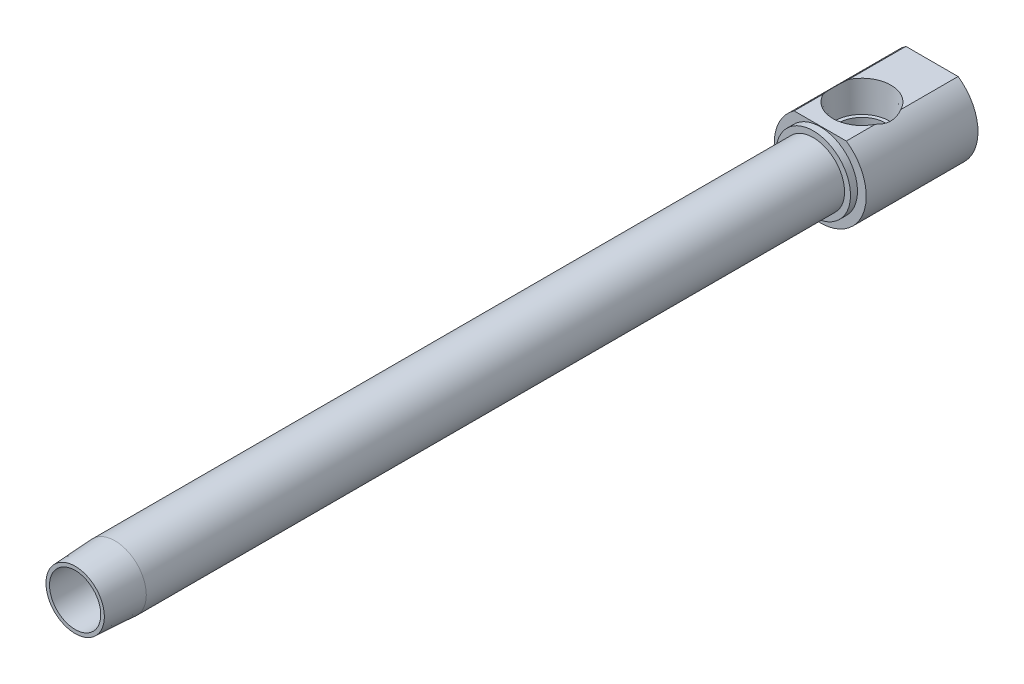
ISO-10303-21;
HEADER;
FILE_DESCRIPTION(('STEP AP214'),'2;1');
FILE_NAME('part.step','',(''),(''),'','','');
FILE_SCHEMA(('AUTOMOTIVE_DESIGN { 1 0 10303 214 1 1 1 1 }'));
ENDSEC;
DATA;
#1=APPLICATION_CONTEXT('core data for automotive mechanical design processes');
#2=APPLICATION_PROTOCOL_DEFINITION('international standard','automotive_design',2000,#1);
#3=PRODUCT_CONTEXT('',#1,'mechanical');
#4=PRODUCT('Part','Part','',(#3));
#5=PRODUCT_RELATED_PRODUCT_CATEGORY('part','',(#4));
#6=PRODUCT_DEFINITION_FORMATION('','',#4);
#7=PRODUCT_DEFINITION_CONTEXT('part definition',#1,'design');
#8=PRODUCT_DEFINITION('design','',#6,#7);
#9=PRODUCT_DEFINITION_SHAPE('','',#8);
#10=(LENGTH_UNIT() NAMED_UNIT(*) SI_UNIT(.MILLI.,.METRE.));
#11=(NAMED_UNIT(*) PLANE_ANGLE_UNIT() SI_UNIT($,.RADIAN.));
#12=(NAMED_UNIT(*) SI_UNIT($,.STERADIAN.) SOLID_ANGLE_UNIT());
#13=UNCERTAINTY_MEASURE_WITH_UNIT(LENGTH_MEASURE(1.E-05),#10,'distance_accuracy_value','');
#14=(GEOMETRIC_REPRESENTATION_CONTEXT(3) GLOBAL_UNCERTAINTY_ASSIGNED_CONTEXT((#13)) GLOBAL_UNIT_ASSIGNED_CONTEXT((#10,
#11,#12)) REPRESENTATION_CONTEXT('',''));
#15=CARTESIAN_POINT('',(0.,0.,0.));
#16=DIRECTION('',(0.,0.,1.));
#17=DIRECTION('',(1.,0.,0.));
#18=AXIS2_PLACEMENT_3D('',#15,#16,#17);
#19=CARTESIAN_POINT('',(0.,0.,-310.147166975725));
#20=DIRECTION('',(0.,0.,-1.));
#21=DIRECTION('',(-1.,0.,0.));
#22=AXIS2_PLACEMENT_3D('',#19,#20,#21);
#23=CYLINDRICAL_SURFACE('',#22,10.6883167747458);
#24=CARTESIAN_POINT('',(0.,0.,-251.6124));
#25=DIRECTION('',(0.,0.,-1.));
#26=DIRECTION('',(-1.,0.,0.));
#27=AXIS2_PLACEMENT_3D('',#24,#25,#26);
#28=CIRCLE('',#27,10.6883167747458);
#29=CARTESIAN_POINT('',(-10.6883167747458,0.,-251.6124));
#30=VERTEX_POINT('',#29);
#31=EDGE_CURVE('E143',#30,#30,#28,.T.);
#32=ORIENTED_EDGE('',*,*,#31,.F.);
#33=EDGE_LOOP('',(#32));
#34=FACE_BOUND('',#33,.T.);
#35=CARTESIAN_POINT('',(0.,0.,-13.5636));
#36=DIRECTION('',(0.,0.,1.));
#37=DIRECTION('',(1.,0.,0.));
#38=AXIS2_PLACEMENT_3D('',#35,#36,#37);
#39=CIRCLE('',#38,10.6883167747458);
#40=CARTESIAN_POINT('',(10.6883167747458,0.,-13.5636));
#41=VERTEX_POINT('',#40);
#42=EDGE_CURVE('E229',#41,#41,#39,.T.);
#43=ORIENTED_EDGE('',*,*,#42,.F.);
#44=EDGE_LOOP('',(#43));
#45=FACE_BOUND('',#44,.T.);
#46=ADVANCED_FACE('F15',(#34,#45),#23,.T.);
#47=CARTESIAN_POINT('',(-8.73125000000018,0.,0.));
#48=DIRECTION('',(0.,0.,1.));
#49=DIRECTION('',(1.,0.,0.));
#50=AXIS2_PLACEMENT_3D('',#47,#48,#49);
#51=PLANE('',#50);
#52=CARTESIAN_POINT('',(0.,0.,0.));
#53=DIRECTION('',(0.,0.,-1.));
#54=DIRECTION('',(-1.,0.,0.));
#55=AXIS2_PLACEMENT_3D('',#52,#53,#54);
#56=CIRCLE('',#55,8.73125000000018);
#57=CARTESIAN_POINT('',(-8.73125000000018,0.,0.));
#58=VERTEX_POINT('',#57);
#59=EDGE_CURVE('E19',#58,#58,#56,.T.);
#60=ORIENTED_EDGE('',*,*,#59,.T.);
#61=EDGE_LOOP('',(#60));
#62=FACE_BOUND('',#61,.T.);
#63=CARTESIAN_POINT('',(0.,0.,0.));
#64=DIRECTION('',(0.,0.,1.));
#65=DIRECTION('',(1.,0.,0.));
#66=AXIS2_PLACEMENT_3D('',#63,#64,#65);
#67=CIRCLE('',#66,9.9568);
#68=CARTESIAN_POINT('',(9.9568,0.,0.));
#69=VERTEX_POINT('',#68);
#70=EDGE_CURVE('E231',#69,#69,#67,.T.);
#71=ORIENTED_EDGE('',*,*,#70,.T.);
#72=EDGE_LOOP('',(#71));
#73=FACE_BOUND('',#72,.T.);
#74=ADVANCED_FACE('F17',(#62,#73),#51,.T.);
#75=CARTESIAN_POINT('',(-8.89,12.9217429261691,-234.95));
#76=DIRECTION('',(0.,-1.,0.));
#77=DIRECTION('',(0.,0.,-1.));
#78=AXIS2_PLACEMENT_3D('',#75,#76,#77);
#79=PLANE('',#78);
#80=DIRECTION('',(0.,0.,-1.));
#81=VECTOR('',#80,1.);
#82=CARTESIAN_POINT('',(8.89,12.9217429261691,-234.95));
#83=LINE('',#82,#81);
#84=CARTESIAN_POINT('',(8.89,12.9217429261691,-254.));
#85=VERTEX_POINT('',#84);
#86=CARTESIAN_POINT('',(8.89,12.9217429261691,-263.898054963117));
#87=VERTEX_POINT('',#86);
#88=EDGE_CURVE('E127',#85,#87,#83,.T.);
#89=ORIENTED_EDGE('',*,*,#88,.T.);
#90=CARTESIAN_POINT('',(0.,12.9217429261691,-268.224));
#91=DIRECTION('',(0.,-1.,0.));
#92=DIRECTION('',(0.,0.,-1.));
#93=AXIS2_PLACEMENT_3D('',#90,#91,#92);
#94=CIRCLE('',#93,9.88665264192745);
#95=CARTESIAN_POINT('',(-8.89,12.9217429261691,-263.898054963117));
#96=VERTEX_POINT('',#95);
#97=EDGE_CURVE('E111',#87,#96,#94,.T.);
#98=ORIENTED_EDGE('',*,*,#97,.T.);
#99=DIRECTION('',(0.,0.,-1.));
#100=VECTOR('',#99,1.);
#101=CARTESIAN_POINT('',(-8.89,12.9217429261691,-234.95));
#102=LINE('',#101,#100);
#103=CARTESIAN_POINT('',(-8.89,12.9217429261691,-254.));
#104=VERTEX_POINT('',#103);
#105=EDGE_CURVE('E138',#104,#96,#102,.T.);
#106=ORIENTED_EDGE('',*,*,#105,.F.);
#107=DIRECTION('',(1.,0.,0.));
#108=VECTOR('',#107,1.);
#109=CARTESIAN_POINT('',(-12.7,12.9217429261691,-254.));
#110=LINE('',#109,#108);
#111=EDGE_CURVE('E135',#104,#85,#110,.T.);
#112=ORIENTED_EDGE('',*,*,#111,.T.);
#113=EDGE_LOOP('',(#89,#98,#106,#112));
#114=FACE_BOUND('',#113,.T.);
#115=ADVANCED_FACE('F133',(#114),#79,.F.);
#116=CARTESIAN_POINT('',(-8.73125000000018,0.,-252.027796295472));
#117=DIRECTION('',(0.,0.,1.));
#118=DIRECTION('',(1.,0.,0.));
#119=AXIS2_PLACEMENT_3D('',#116,#117,#118);
#120=PLANE('',#119);
#121=CARTESIAN_POINT('',(0.,0.,-252.027796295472));
#122=DIRECTION('',(0.,0.,-1.));
#123=DIRECTION('',(-1.,0.,0.));
#124=AXIS2_PLACEMENT_3D('',#121,#122,#123);
#125=CIRCLE('',#124,8.73125000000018);
#126=CARTESIAN_POINT('',(-8.73125000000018,0.,-252.027796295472));
#127=VERTEX_POINT('',#126);
#128=EDGE_CURVE('E157',#127,#127,#125,.T.);
#129=ORIENTED_EDGE('',*,*,#128,.F.);
#130=EDGE_LOOP('',(#129));
#131=FACE_BOUND('',#130,.T.);
#132=CARTESIAN_POINT('',(0.,-1.53831558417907,-252.027796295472));
#133=DIRECTION('',(0.,0.,1.));
#134=DIRECTION('',(0.,1.,0.));
#135=AXIS2_PLACEMENT_3D('',#132,#133,#134);
#136=ELLIPSE('',#135,7.0682508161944,6.80767250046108);
#137=CARTESIAN_POINT('',(0.,5.52993523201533,-252.027796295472));
#138=VERTEX_POINT('',#137);
#139=EDGE_CURVE('E162',#138,#138,#136,.F.);
#140=ORIENTED_EDGE('',*,*,#139,.T.);
#141=EDGE_LOOP('',(#140));
#142=FACE_BOUND('',#141,.T.);
#143=ADVANCED_FACE('F211',(#131,#142),#120,.T.);
#144=CARTESIAN_POINT('',(0.,0.,-310.147166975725));
#145=DIRECTION('',(0.,0.,-1.));
#146=DIRECTION('',(-1.,0.,0.));
#147=AXIS2_PLACEMENT_3D('',#144,#145,#146);
#148=CYLINDRICAL_SURFACE('',#147,8.73125000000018);
#149=ORIENTED_EDGE('',*,*,#128,.T.);
#150=EDGE_LOOP('',(#149));
#151=FACE_BOUND('',#150,.T.);
#152=ORIENTED_EDGE('',*,*,#59,.F.);
#153=EDGE_LOOP('',(#152));
#154=FACE_BOUND('',#153,.T.);
#155=ADVANCED_FACE('F209',(#151,#154),#148,.F.);
#156=CARTESIAN_POINT('',(-15.6845,0.,-292.1));
#157=DIRECTION('',(0.,0.,-1.));
#158=DIRECTION('',(-1.,0.,0.));
#159=AXIS2_PLACEMENT_3D('',#156,#157,#158);
#160=PLANE('',#159);
#161=DIRECTION('',(1.,0.,0.));
#162=VECTOR('',#161,1.);
#163=CARTESIAN_POINT('',(-3.66617420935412,6.35,-292.1));
#164=LINE('',#163,#162);
#165=CARTESIAN_POINT('',(-3.66617420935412,6.35,-292.1));
#166=VERTEX_POINT('',#165);
#167=CARTESIAN_POINT('',(3.66617420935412,6.35,-292.1));
#168=VERTEX_POINT('',#167);
#169=EDGE_CURVE('E165',#166,#168,#164,.T.);
#170=ORIENTED_EDGE('',*,*,#169,.F.);
#171=DIRECTION('',(0.5,0.866025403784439,0.));
#172=VECTOR('',#171,1.);
#173=CARTESIAN_POINT('',(-7.33234841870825,0.,-292.1));
#174=LINE('',#173,#172);
#175=CARTESIAN_POINT('',(-7.33234841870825,0.,-292.1));
#176=VERTEX_POINT('',#175);
#177=EDGE_CURVE('E284',#176,#166,#174,.T.);
#178=ORIENTED_EDGE('',*,*,#177,.F.);
#179=DIRECTION('',(-0.5,0.866025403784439,0.));
#180=VECTOR('',#179,1.);
#181=CARTESIAN_POINT('',(-3.66617420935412,-6.35,-292.1));
#182=LINE('',#181,#180);
#183=CARTESIAN_POINT('',(-3.66617420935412,-6.35,-292.1));
#184=VERTEX_POINT('',#183);
#185=EDGE_CURVE('E310',#184,#176,#182,.T.);
#186=ORIENTED_EDGE('',*,*,#185,.F.);
#187=DIRECTION('',(-1.,0.,0.));
#188=VECTOR('',#187,1.);
#189=CARTESIAN_POINT('',(3.66617420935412,-6.35,-292.1));
#190=LINE('',#189,#188);
#191=CARTESIAN_POINT('',(3.66617420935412,-6.35,-292.1));
#192=VERTEX_POINT('',#191);
#193=EDGE_CURVE('E307',#192,#184,#190,.T.);
#194=ORIENTED_EDGE('',*,*,#193,.F.);
#195=DIRECTION('',(-0.5,-0.866025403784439,0.));
#196=VECTOR('',#195,1.);
#197=CARTESIAN_POINT('',(7.33234841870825,0.,-292.1));
#198=LINE('',#197,#196);
#199=CARTESIAN_POINT('',(7.33234841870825,0.,-292.1));
#200=VERTEX_POINT('',#199);
#201=EDGE_CURVE('E304',#200,#192,#198,.T.);
#202=ORIENTED_EDGE('',*,*,#201,.F.);
#203=DIRECTION('',(0.5,-0.866025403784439,0.));
#204=VECTOR('',#203,1.);
#205=CARTESIAN_POINT('',(3.66617420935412,6.35,-292.1));
#206=LINE('',#205,#204);
#207=EDGE_CURVE('E301',#168,#200,#206,.T.);
#208=ORIENTED_EDGE('',*,*,#207,.F.);
#209=EDGE_LOOP('',(#170,#178,#186,#194,#202,#208));
#210=FACE_BOUND('',#209,.T.);
#211=DIRECTION('',(-1.,0.,0.));
#212=VECTOR('',#211,1.);
#213=CARTESIAN_POINT('',(-8.89,12.9217429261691,-292.1));
#214=LINE('',#213,#212);
#215=CARTESIAN_POINT('',(8.89,12.9217429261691,-292.1));
#216=VERTEX_POINT('',#215);
#217=CARTESIAN_POINT('',(-8.89,12.9217429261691,-292.1));
#218=VERTEX_POINT('',#217);
#219=EDGE_CURVE('E140',#216,#218,#214,.T.);
#220=ORIENTED_EDGE('',*,*,#219,.F.);
#221=CARTESIAN_POINT('',(0.,0.,-292.1));
#222=DIRECTION('',(0.,0.,-1.));
#223=DIRECTION('',(-1.,0.,0.));
#224=AXIS2_PLACEMENT_3D('',#221,#222,#223);
#225=CIRCLE('',#224,15.6845);
#226=EDGE_CURVE('E154',#216,#218,#225,.T.);
#227=ORIENTED_EDGE('',*,*,#226,.T.);
#228=EDGE_LOOP('',(#220,#227));
#229=FACE_BOUND('',#228,.T.);
#230=ADVANCED_FACE('F204',(#210,#229),#160,.T.);
#231=CARTESIAN_POINT('',(0.,0.,-310.147166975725));
#232=DIRECTION('',(0.,0.,-1.));
#233=DIRECTION('',(-1.,0.,0.));
#234=AXIS2_PLACEMENT_3D('',#231,#232,#233);
#235=CYLINDRICAL_SURFACE('',#234,15.6845);
#236=CARTESIAN_POINT('',(6.18126199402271,14.4151149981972,-260.407890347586));
#237=CARTESIAN_POINT('',(6.40820210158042,14.317827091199,-260.593892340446));
#238=CARTESIAN_POINT('',(6.62617183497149,14.2179923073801,-260.789429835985));
#239=CARTESIAN_POINT('',(7.04356392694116,14.015896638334,-261.198561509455));
#240=CARTESIAN_POINT('',(7.24297338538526,13.9136341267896,-261.412168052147));
#241=CARTESIAN_POINT('',(7.62085258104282,13.7102837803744,-261.854442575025));
#242=CARTESIAN_POINT('',(7.79947267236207,13.6091929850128,-262.082980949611));
#243=CARTESIAN_POINT('',(8.13667540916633,13.4103063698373,-262.555534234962));
#244=CARTESIAN_POINT('',(8.29527210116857,13.3125082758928,-262.799538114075));
#245=CARTESIAN_POINT('',(8.52405372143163,13.1663669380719,-263.187604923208));
#246=CARTESIAN_POINT('',(8.60159506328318,13.1157948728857,-263.326544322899));
#247=CARTESIAN_POINT('',(8.75042416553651,13.0169736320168,-263.608789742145));
#248=CARTESIAN_POINT('',(8.82170394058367,12.9687274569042,-263.75210103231));
#249=CARTESIAN_POINT('',(8.98942344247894,12.85334420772,-264.110530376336));
#250=CARTESIAN_POINT('',(9.08209775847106,12.7878879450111,-264.327972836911));
#251=CARTESIAN_POINT('',(9.25265845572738,12.6650269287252,-264.770791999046));
#252=CARTESIAN_POINT('',(9.33054529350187,12.6076219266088,-264.996168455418));
#253=CARTESIAN_POINT('',(9.47086217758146,12.5025600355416,-265.454136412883));
#254=CARTESIAN_POINT('',(9.53327990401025,12.4549109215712,-265.686733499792));
#255=CARTESIAN_POINT('',(9.64181076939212,12.3710847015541,-266.157621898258));
#256=CARTESIAN_POINT('',(9.68793245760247,12.3349015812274,-266.395910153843));
#257=CARTESIAN_POINT('',(9.76349281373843,12.2751820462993,-266.878204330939));
#258=CARTESIAN_POINT('',(9.79282896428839,12.2517233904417,-267.122236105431));
#259=CARTESIAN_POINT('',(9.83390591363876,12.2187780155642,-267.612731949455));
#260=CARTESIAN_POINT('',(9.84564637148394,12.2092915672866,-267.859196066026));
#261=CARTESIAN_POINT('',(9.85132494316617,12.2047101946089,-268.352460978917));
#262=CARTESIAN_POINT('',(9.84526326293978,12.2096151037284,-268.599261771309));
#263=CARTESIAN_POINT('',(9.81544491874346,12.233598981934,-269.091077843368));
#264=CARTESIAN_POINT('',(9.79168936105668,12.2526770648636,-269.336093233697));
#265=CARTESIAN_POINT('',(9.7294701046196,12.3021291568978,-269.803007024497));
#266=CARTESIAN_POINT('',(9.69232783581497,12.3314830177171,-270.025192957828));
#267=CARTESIAN_POINT('',(9.60385268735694,12.400512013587,-270.465181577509));
#268=CARTESIAN_POINT('',(9.55251354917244,12.4401917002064,-270.682982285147));
#269=CARTESIAN_POINT('',(9.43631194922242,12.5285621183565,-271.112660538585));
#270=CARTESIAN_POINT('',(9.37147123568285,12.5772383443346,-271.324546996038));
#271=CARTESIAN_POINT('',(9.22879623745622,12.6822986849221,-271.741936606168));
#272=CARTESIAN_POINT('',(9.15096192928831,12.7386828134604,-271.947439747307));
#273=CARTESIAN_POINT('',(9.01061877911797,12.838109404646,-272.284726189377));
#274=CARTESIAN_POINT('',(8.95152353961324,12.8794177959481,-272.418466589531));
#275=CARTESIAN_POINT('',(8.76461266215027,13.0080031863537,-272.817903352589));
#276=CARTESIAN_POINT('',(8.62838014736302,13.0990466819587,-273.078521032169));
#277=CARTESIAN_POINT('',(8.33484719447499,13.2877507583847,-273.585122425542));
#278=CARTESIAN_POINT('',(8.17753852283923,13.3854139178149,-273.831100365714));
#279=CARTESIAN_POINT('',(7.84238437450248,13.5844995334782,-274.3080815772));
#280=CARTESIAN_POINT('',(7.66448703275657,13.685931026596,-274.539044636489));
#281=CARTESIAN_POINT('',(7.28939666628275,13.8893391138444,-274.984214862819));
#282=CARTESIAN_POINT('',(7.09221474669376,13.9913153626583,-275.198431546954));
#283=CARTESIAN_POINT('',(6.68803601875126,14.1888008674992,-275.600395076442));
#284=CARTESIAN_POINT('',(6.48182024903,14.284400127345,-275.788882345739));
#285=CARTESIAN_POINT('',(6.05384699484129,14.4709681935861,-276.147789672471));
#286=CARTESIAN_POINT('',(5.83215453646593,14.5619538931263,-276.318278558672));
#287=CARTESIAN_POINT('',(5.60267382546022,14.6496957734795,-276.479590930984));
#288=B_SPLINE_CURVE_WITH_KNOTS('',3,(#236,#237,#238,#239,#240,#241,#242,#243,#244,#245,#246,
#247,#248,#249,#250,#251,#252,#253,#254,#255,#256,#257,#258,#259,#260,#261,#262,#263,#264,#265,
#266,#267,#268,#269,#270,#271,#272,#273,#274,#275,#276,#277,#278,#279,#280,#281,#282,#283,#284,
#285,#286,#287),.UNSPECIFIED.,.F.,.F.,(4,2,2,2,2,2,2,2,2,2,2,2,2,2,2,2,2,2,2,2,2,2,2,2,2,4),(0.,
0.927053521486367,1.85474664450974,2.77524763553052,3.69509925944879,4.19580328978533,
4.69713686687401,5.43222687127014,6.16729417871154,6.90294503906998,7.63820938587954,
8.37791768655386,9.11764032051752,9.85735439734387,10.5970222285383,11.2778067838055,
11.9588919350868,12.6388883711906,13.3188860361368,13.7745816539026,14.696795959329,
15.6193715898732,16.5443240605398,17.4687469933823,18.3536130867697,19.2349623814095),.UNSPECIFIED.);
#289=CARTESIAN_POINT('',(8.89,12.9217429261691,-272.549945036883));
#290=VERTEX_POINT('',#289);
#291=EDGE_CURVE('E31',#87,#290,#288,.T.);
#292=ORIENTED_EDGE('',*,*,#291,.F.);
#293=ORIENTED_EDGE('',*,*,#88,.F.);
#294=CARTESIAN_POINT('',(0.,0.,-254.));
#295=DIRECTION('',(0.,0.,-1.));
#296=DIRECTION('',(-1.,0.,0.));
#297=AXIS2_PLACEMENT_3D('',#294,#295,#296);
#298=CIRCLE('',#297,15.6845);
#299=EDGE_CURVE('E152',#85,#104,#298,.T.);
#300=ORIENTED_EDGE('',*,*,#299,.T.);
#301=ORIENTED_EDGE('',*,*,#105,.T.);
#302=CARTESIAN_POINT('',(-5.60267382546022,14.6496957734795,-276.479590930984));
#303=CARTESIAN_POINT('',(-5.83916916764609,14.5592741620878,-276.313346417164));
#304=CARTESIAN_POINT('',(-6.0673939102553,14.4654038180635,-276.137356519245));
#305=CARTESIAN_POINT('',(-6.50657666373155,14.2732361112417,-275.767106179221));
#306=CARTESIAN_POINT('',(-6.71753229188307,14.1749381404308,-275.572843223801));
#307=CARTESIAN_POINT('',(-7.12045557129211,13.9768691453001,-275.16824748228));
#308=CARTESIAN_POINT('',(-7.31250621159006,13.8771069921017,-274.957992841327));
#309=CARTESIAN_POINT('',(-7.67797599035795,13.6782845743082,-274.521703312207));
#310=CARTESIAN_POINT('',(-7.85140185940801,13.5792240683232,-274.295674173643));
#311=CARTESIAN_POINT('',(-8.18139016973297,13.3830412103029,-273.825173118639));
#312=CARTESIAN_POINT('',(-8.33766306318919,13.2859696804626,-273.580476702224));
#313=CARTESIAN_POINT('',(-8.62954581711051,13.0982677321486,-273.076292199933));
#314=CARTESIAN_POINT('',(-8.76513502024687,13.0076438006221,-272.816789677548));
#315=CARTESIAN_POINT('',(-8.98947377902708,12.8533099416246,-272.337363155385));
#316=CARTESIAN_POINT('',(-9.08217383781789,12.7878343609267,-272.119849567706));
#317=CARTESIAN_POINT('',(-9.25276992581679,12.6649454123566,-271.676898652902));
#318=CARTESIAN_POINT('',(-9.33066889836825,12.6075304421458,-271.451462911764));
#319=CARTESIAN_POINT('',(-9.47096094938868,12.5024850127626,-270.993506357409));
#320=CARTESIAN_POINT('',(-9.53335030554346,12.4548569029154,-270.76098385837));
#321=CARTESIAN_POINT('',(-9.64183755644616,12.3710636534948,-270.290239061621));
#322=CARTESIAN_POINT('',(-9.68794342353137,12.3348929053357,-270.052019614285));
#323=CARTESIAN_POINT('',(-9.76349062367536,12.2751837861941,-269.569809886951));
#324=CARTESIAN_POINT('',(-9.79282550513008,12.2517261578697,-269.325792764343));
#325=CARTESIAN_POINT('',(-9.83390185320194,12.2187812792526,-268.835328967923));
#326=CARTESIAN_POINT('',(-9.84564316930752,12.2092941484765,-268.588882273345));
#327=CARTESIAN_POINT('',(-9.85132631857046,12.2047090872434,-268.095619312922));
#328=CARTESIAN_POINT('',(-9.84526600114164,12.2096128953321,-267.848803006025));
#329=CARTESIAN_POINT('',(-9.81544809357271,12.2335964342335,-267.356954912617));
#330=CARTESIAN_POINT('',(-9.79169153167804,12.2526753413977,-267.111923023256));
#331=CARTESIAN_POINT('',(-9.72947134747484,12.3021281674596,-266.645002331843));
#332=CARTESIAN_POINT('',(-9.69233092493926,12.3314805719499,-266.422825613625));
#333=CARTESIAN_POINT('',(-9.60386128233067,12.4005053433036,-265.982857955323));
#334=CARTESIAN_POINT('',(-9.55252598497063,12.4401821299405,-265.7650689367));
#335=CARTESIAN_POINT('',(-9.43632738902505,12.5285504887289,-265.33539132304));
#336=CARTESIAN_POINT('',(-9.37148448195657,12.5772284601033,-265.123494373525));
#337=CARTESIAN_POINT('',(-9.22880457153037,12.6822926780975,-264.706085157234));
#338=CARTESIAN_POINT('',(-9.15096746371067,12.7386789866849,-264.500572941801));
#339=CARTESIAN_POINT('',(-9.01061796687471,12.8381099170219,-264.163272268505));
#340=CARTESIAN_POINT('',(-8.95152097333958,12.8794194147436,-264.029528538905));
#341=CARTESIAN_POINT('',(-8.80068775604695,12.9831855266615,-263.707189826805));
#342=CARTESIAN_POINT('',(-8.70603543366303,13.0469462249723,-263.520366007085));
#343=CARTESIAN_POINT('',(-8.50583150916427,13.1783430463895,-263.153845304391));
#344=CARTESIAN_POINT('',(-8.40026939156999,13.2459828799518,-262.974155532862));
#345=CARTESIAN_POINT('',(-8.14693598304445,13.403699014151,-262.572018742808));
#346=CARTESIAN_POINT('',(-7.99573471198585,13.4946529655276,-262.352065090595));
#347=CARTESIAN_POINT('',(-7.67663330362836,13.6786987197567,-261.925415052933));
#348=CARTESIAN_POINT('',(-7.50872479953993,13.7717915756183,-261.718725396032));
#349=CARTESIAN_POINT('',(-7.1565512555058,13.9580450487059,-261.319106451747));
#350=CARTESIAN_POINT('',(-6.97225920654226,14.0512055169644,-261.126200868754));
#351=CARTESIAN_POINT('',(-6.58822039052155,14.2353204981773,-260.755512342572));
#352=CARTESIAN_POINT('',(-6.38848080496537,14.3262760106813,-260.577722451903));
#353=CARTESIAN_POINT('',(-6.18126199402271,14.4151149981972,-260.407890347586));
#354=B_SPLINE_CURVE_WITH_KNOTS('',3,(#302,#303,#304,#305,#306,#307,#308,#309,#310,#311,#312,
#313,#314,#315,#316,#317,#318,#319,#320,#321,#322,#323,#324,#325,#326,#327,#328,#329,#330,#331,
#332,#333,#334,#335,#336,#337,#338,#339,#340,#341,#342,#343,#344,#345,#346,#347,#348,#349,#350,
#351,#352,#353),.UNSPECIFIED.,.F.,.F.,(4,2,2,2,2,2,2,2,2,2,2,2,2,2,2,2,2,2,2,2,2,2,2,2,2,4),(0.,
0.908274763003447,1.81667463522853,2.72089010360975,3.62477770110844,4.54212421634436,
5.46038099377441,6.19576092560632,6.93099446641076,7.66640429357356,8.40145356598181,
9.14111809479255,9.88078895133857,10.6205491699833,11.360266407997,12.0410224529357,
12.7220704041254,13.4020975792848,14.0821302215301,14.5378258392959,15.1941212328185,
15.8510552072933,16.6961350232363,17.5416401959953,18.3885660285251,19.2351004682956),.UNSPECIFIED.);
#355=CARTESIAN_POINT('',(-8.89,12.9217429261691,-272.549945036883));
#356=VERTEX_POINT('',#355);
#357=EDGE_CURVE('E115',#356,#96,#354,.T.);
#358=ORIENTED_EDGE('',*,*,#357,.F.);
#359=EDGE_CURVE('E136',#356,#218,#102,.T.);
#360=ORIENTED_EDGE('',*,*,#359,.T.);
#361=ORIENTED_EDGE('',*,*,#226,.F.);
#362=EDGE_CURVE('E130',#290,#216,#83,.T.);
#363=ORIENTED_EDGE('',*,*,#362,.F.);
#364=EDGE_LOOP('',(#292,#293,#300,#301,#358,#360,#361,#363));
#365=FACE_BOUND('',#364,.T.);
#366=ADVANCED_FACE('F125',(#365),#235,.T.);
#367=CARTESIAN_POINT('',(-12.7,0.,-254.));
#368=DIRECTION('',(0.,0.,1.));
#369=DIRECTION('',(1.,0.,0.));
#370=AXIS2_PLACEMENT_3D('',#367,#368,#369);
#371=PLANE('',#370);
#372=ORIENTED_EDGE('',*,*,#111,.F.);
#373=ORIENTED_EDGE('',*,*,#299,.F.);
#374=EDGE_LOOP('',(#372,#373));
#375=FACE_BOUND('',#374,.T.);
#376=CARTESIAN_POINT('',(0.,0.,-254.));
#377=DIRECTION('',(0.,0.,-1.));
#378=DIRECTION('',(-1.,0.,0.));
#379=AXIS2_PLACEMENT_3D('',#376,#377,#378);
#380=CIRCLE('',#379,12.7);
#381=CARTESIAN_POINT('',(-12.7,0.,-254.));
#382=VERTEX_POINT('',#381);
#383=EDGE_CURVE('E149',#382,#382,#380,.T.);
#384=ORIENTED_EDGE('',*,*,#383,.T.);
#385=EDGE_LOOP('',(#384));
#386=FACE_BOUND('',#385,.T.);
#387=ADVANCED_FACE('F203',(#375,#386),#371,.T.);
#388=CARTESIAN_POINT('',(0.,0.,-310.147166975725));
#389=DIRECTION('',(0.,0.,-1.));
#390=DIRECTION('',(-1.,0.,0.));
#391=AXIS2_PLACEMENT_3D('',#388,#389,#390);
#392=CYLINDRICAL_SURFACE('',#391,12.7);
#393=CARTESIAN_POINT('',(0.,0.,-251.6124));
#394=DIRECTION('',(0.,0.,-1.));
#395=DIRECTION('',(-1.,0.,0.));
#396=AXIS2_PLACEMENT_3D('',#393,#394,#395);
#397=CIRCLE('',#396,12.7);
#398=CARTESIAN_POINT('',(-12.7,0.,-251.6124));
#399=VERTEX_POINT('',#398);
#400=EDGE_CURVE('E146',#399,#399,#397,.T.);
#401=ORIENTED_EDGE('',*,*,#400,.T.);
#402=EDGE_LOOP('',(#401));
#403=FACE_BOUND('',#402,.T.);
#404=ORIENTED_EDGE('',*,*,#383,.F.);
#405=EDGE_LOOP('',(#404));
#406=FACE_BOUND('',#405,.T.);
#407=ADVANCED_FACE('F335',(#403,#406),#392,.T.);
#408=CARTESIAN_POINT('',(-10.6883167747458,0.,-251.6124));
#409=DIRECTION('',(0.,0.,1.));
#410=DIRECTION('',(1.,0.,0.));
#411=AXIS2_PLACEMENT_3D('',#408,#409,#410);
#412=PLANE('',#411);
#413=ORIENTED_EDGE('',*,*,#31,.T.);
#414=EDGE_LOOP('',(#413));
#415=FACE_BOUND('',#414,.T.);
#416=ORIENTED_EDGE('',*,*,#400,.F.);
#417=EDGE_LOOP('',(#416));
#418=FACE_BOUND('',#417,.T.);
#419=ADVANCED_FACE('F339',(#415,#418),#412,.T.);
#420=ORIENTED_EDGE('',*,*,#359,.F.);
#421=EDGE_CURVE('E120',#356,#290,#94,.T.);
#422=ORIENTED_EDGE('',*,*,#421,.T.);
#423=ORIENTED_EDGE('',*,*,#362,.T.);
#424=ORIENTED_EDGE('',*,*,#219,.T.);
#425=EDGE_LOOP('',(#420,#422,#423,#424));
#426=FACE_BOUND('',#425,.T.);
#427=ADVANCED_FACE('F330',(#426),#79,.F.);
#428=CARTESIAN_POINT('',(-3.66617420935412,6.35,-285.75));
#429=DIRECTION('',(0.,1.,0.));
#430=DIRECTION('',(-1.,0.,0.));
#431=AXIS2_PLACEMENT_3D('',#428,#429,#430);
#432=PLANE('',#431);
#433=ORIENTED_EDGE('',*,*,#169,.T.);
#434=DIRECTION('',(0.,0.,-1.));
#435=VECTOR('',#434,1.);
#436=CARTESIAN_POINT('',(3.66617420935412,6.35,-285.75));
#437=LINE('',#436,#435);
#438=CARTESIAN_POINT('',(3.66617420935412,6.35,-285.75));
#439=VERTEX_POINT('',#438);
#440=EDGE_CURVE('E299',#439,#168,#437,.T.);
#441=ORIENTED_EDGE('',*,*,#440,.F.);
#442=DIRECTION('',(1.,0.,0.));
#443=VECTOR('',#442,1.);
#444=CARTESIAN_POINT('',(-3.66617420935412,6.35,-285.75));
#445=LINE('',#444,#443);
#446=CARTESIAN_POINT('',(-3.66617420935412,6.35,-285.75));
#447=VERTEX_POINT('',#446);
#448=EDGE_CURVE('E280',#447,#439,#445,.T.);
#449=ORIENTED_EDGE('',*,*,#448,.F.);
#450=DIRECTION('',(0.,0.,-1.));
#451=VECTOR('',#450,1.);
#452=CARTESIAN_POINT('',(-3.66617420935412,6.35,-285.75));
#453=LINE('',#452,#451);
#454=EDGE_CURVE('E315',#447,#166,#453,.T.);
#455=ORIENTED_EDGE('',*,*,#454,.T.);
#456=EDGE_LOOP('',(#433,#441,#449,#455));
#457=FACE_BOUND('',#456,.T.);
#458=ADVANCED_FACE('F350',(#457),#432,.F.);
#459=CARTESIAN_POINT('',(-7.33234841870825,0.,-285.75));
#460=DIRECTION('',(-0.866025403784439,0.5,0.));
#461=DIRECTION('',(-0.5,-0.866025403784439,0.));
#462=AXIS2_PLACEMENT_3D('',#459,#460,#461);
#463=PLANE('',#462);
#464=ORIENTED_EDGE('',*,*,#177,.T.);
#465=ORIENTED_EDGE('',*,*,#454,.F.);
#466=DIRECTION('',(0.5,0.866025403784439,0.));
#467=VECTOR('',#466,1.);
#468=CARTESIAN_POINT('',(-7.33234841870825,0.,-285.75));
#469=LINE('',#468,#467);
#470=CARTESIAN_POINT('',(-7.33234841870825,0.,-285.75));
#471=VERTEX_POINT('',#470);
#472=EDGE_CURVE('E296',#471,#447,#469,.T.);
#473=ORIENTED_EDGE('',*,*,#472,.F.);
#474=DIRECTION('',(0.,0.,-1.));
#475=VECTOR('',#474,1.);
#476=CARTESIAN_POINT('',(-7.33234841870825,0.,-285.75));
#477=LINE('',#476,#475);
#478=EDGE_CURVE('E317',#471,#176,#477,.T.);
#479=ORIENTED_EDGE('',*,*,#478,.T.);
#480=EDGE_LOOP('',(#464,#465,#473,#479));
#481=FACE_BOUND('',#480,.T.);
#482=ADVANCED_FACE('F353',(#481),#463,.F.);
#483=CARTESIAN_POINT('',(-3.66617420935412,-6.35,-285.75));
#484=DIRECTION('',(-0.866025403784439,-0.5,0.));
#485=DIRECTION('',(0.5,-0.866025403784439,0.));
#486=AXIS2_PLACEMENT_3D('',#483,#484,#485);
#487=PLANE('',#486);
#488=ORIENTED_EDGE('',*,*,#185,.T.);
#489=ORIENTED_EDGE('',*,*,#478,.F.);
#490=DIRECTION('',(-0.5,0.866025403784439,0.));
#491=VECTOR('',#490,1.);
#492=CARTESIAN_POINT('',(-3.66617420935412,-6.35,-285.75));
#493=LINE('',#492,#491);
#494=CARTESIAN_POINT('',(-3.66617420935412,-6.35,-285.75));
#495=VERTEX_POINT('',#494);
#496=EDGE_CURVE('E293',#495,#471,#493,.T.);
#497=ORIENTED_EDGE('',*,*,#496,.F.);
#498=DIRECTION('',(0.,0.,-1.));
#499=VECTOR('',#498,1.);
#500=CARTESIAN_POINT('',(-3.66617420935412,-6.35,-285.75));
#501=LINE('',#500,#499);
#502=EDGE_CURVE('E319',#495,#184,#501,.T.);
#503=ORIENTED_EDGE('',*,*,#502,.T.);
#504=EDGE_LOOP('',(#488,#489,#497,#503));
#505=FACE_BOUND('',#504,.T.);
#506=ADVANCED_FACE('F367',(#505),#487,.F.);
#507=CARTESIAN_POINT('',(3.66617420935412,-6.35,-285.75));
#508=DIRECTION('',(0.,-1.,0.));
#509=DIRECTION('',(1.,0.,0.));
#510=AXIS2_PLACEMENT_3D('',#507,#508,#509);
#511=PLANE('',#510);
#512=ORIENTED_EDGE('',*,*,#193,.T.);
#513=ORIENTED_EDGE('',*,*,#502,.F.);
#514=DIRECTION('',(-1.,0.,0.));
#515=VECTOR('',#514,1.);
#516=CARTESIAN_POINT('',(3.66617420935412,-6.35,-285.75));
#517=LINE('',#516,#515);
#518=CARTESIAN_POINT('',(3.66617420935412,-6.35,-285.75));
#519=VERTEX_POINT('',#518);
#520=EDGE_CURVE('E290',#519,#495,#517,.T.);
#521=ORIENTED_EDGE('',*,*,#520,.F.);
#522=DIRECTION('',(0.,0.,-1.));
#523=VECTOR('',#522,1.);
#524=CARTESIAN_POINT('',(3.66617420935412,-6.35,-285.75));
#525=LINE('',#524,#523);
#526=EDGE_CURVE('E321',#519,#192,#525,.T.);
#527=ORIENTED_EDGE('',*,*,#526,.T.);
#528=EDGE_LOOP('',(#512,#513,#521,#527));
#529=FACE_BOUND('',#528,.T.);
#530=ADVANCED_FACE('F363',(#529),#511,.F.);
#531=CARTESIAN_POINT('',(7.33234841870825,0.,-285.75));
#532=DIRECTION('',(0.866025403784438,-0.5,0.));
#533=DIRECTION('',(0.5,0.866025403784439,0.));
#534=AXIS2_PLACEMENT_3D('',#531,#532,#533);
#535=PLANE('',#534);
#536=ORIENTED_EDGE('',*,*,#201,.T.);
#537=ORIENTED_EDGE('',*,*,#526,.F.);
#538=DIRECTION('',(-0.5,-0.866025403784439,0.));
#539=VECTOR('',#538,1.);
#540=CARTESIAN_POINT('',(7.33234841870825,0.,-285.75));
#541=LINE('',#540,#539);
#542=CARTESIAN_POINT('',(7.33234841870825,0.,-285.75));
#543=VERTEX_POINT('',#542);
#544=EDGE_CURVE('E287',#543,#519,#541,.T.);
#545=ORIENTED_EDGE('',*,*,#544,.F.);
#546=DIRECTION('',(0.,0.,-1.));
#547=VECTOR('',#546,1.);
#548=CARTESIAN_POINT('',(7.33234841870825,0.,-285.75));
#549=LINE('',#548,#547);
#550=EDGE_CURVE('E323',#543,#200,#549,.T.);
#551=ORIENTED_EDGE('',*,*,#550,.T.);
#552=EDGE_LOOP('',(#536,#537,#545,#551));
#553=FACE_BOUND('',#552,.T.);
#554=ADVANCED_FACE('F359',(#553),#535,.F.);
#555=CARTESIAN_POINT('',(3.66617420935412,6.35,-285.75));
#556=DIRECTION('',(0.866025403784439,0.5,0.));
#557=DIRECTION('',(-0.5,0.866025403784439,0.));
#558=AXIS2_PLACEMENT_3D('',#555,#556,#557);
#559=PLANE('',#558);
#560=ORIENTED_EDGE('',*,*,#207,.T.);
#561=ORIENTED_EDGE('',*,*,#550,.F.);
#562=DIRECTION('',(0.5,-0.866025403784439,0.));
#563=VECTOR('',#562,1.);
#564=CARTESIAN_POINT('',(3.66617420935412,6.35,-285.75));
#565=LINE('',#564,#563);
#566=EDGE_CURVE('E283',#439,#543,#565,.T.);
#567=ORIENTED_EDGE('',*,*,#566,.F.);
#568=ORIENTED_EDGE('',*,*,#440,.T.);
#569=EDGE_LOOP('',(#560,#561,#567,#568));
#570=FACE_BOUND('',#569,.T.);
#571=ADVANCED_FACE('F355',(#570),#559,.F.);
#572=CARTESIAN_POINT('',(0.,0.,-285.75));
#573=DIRECTION('',(0.,0.,-1.));
#574=DIRECTION('',(-1.,0.,0.));
#575=AXIS2_PLACEMENT_3D('',#572,#573,#574);
#576=PLANE('',#575);
#577=ORIENTED_EDGE('',*,*,#448,.T.);
#578=ORIENTED_EDGE('',*,*,#566,.T.);
#579=ORIENTED_EDGE('',*,*,#544,.T.);
#580=ORIENTED_EDGE('',*,*,#520,.T.);
#581=ORIENTED_EDGE('',*,*,#496,.T.);
#582=ORIENTED_EDGE('',*,*,#472,.T.);
#583=EDGE_LOOP('',(#577,#578,#579,#580,#581,#582));
#584=FACE_BOUND('',#583,.T.);
#585=ADVANCED_FACE('F358',(#584),#576,.T.);
#586=CARTESIAN_POINT('',(0.,-6.16022605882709,-267.884880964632));
#587=DIRECTION('',(0.,0.267292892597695,0.963615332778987));
#588=DIRECTION('',(0.,-0.963615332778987,0.267292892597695));
#589=AXIS2_PLACEMENT_3D('',#586,#587,#588);
#590=CONICAL_SURFACE('',#589,4.92936747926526,0.794181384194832);
#591=CARTESIAN_POINT('',(-4.92956747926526,-6.70529941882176,-267.699424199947));
#592=CARTESIAN_POINT('',(-4.86454849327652,-6.74578087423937,-267.751070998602));
#593=CARTESIAN_POINT('',(-4.79934438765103,-6.7860241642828,-267.802671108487));
#594=CARTESIAN_POINT('',(-4.6685319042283,-6.86595614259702,-267.905790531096));
#595=CARTESIAN_POINT('',(-4.60292352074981,-6.90564482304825,-267.957309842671));
#596=CARTESIAN_POINT('',(-4.40534693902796,-7.02381768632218,-268.111838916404));
#597=CARTESIAN_POINT('',(-4.27272274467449,-7.10134897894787,-268.21474396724));
#598=CARTESIAN_POINT('',(-4.00251092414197,-7.25460162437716,-268.422758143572));
#599=CARTESIAN_POINT('',(-3.86487828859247,-7.33024565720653,-268.527865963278));
#600=CARTESIAN_POINT('',(-3.58724919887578,-7.4763106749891,-268.738527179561));
#601=CARTESIAN_POINT('',(-3.44725356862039,-7.54673343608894,-268.844080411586));
#602=CARTESIAN_POINT('',(-3.21819876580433,-7.65449614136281,-269.016695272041));
#603=CARTESIAN_POINT('',(-3.1298916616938,-7.69427803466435,-269.083222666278));
#604=CARTESIAN_POINT('',(-2.95246158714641,-7.76968051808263,-269.217521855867));
#605=CARTESIAN_POINT('',(-2.86333881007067,-7.80530206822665,-269.285293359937));
#606=CARTESIAN_POINT('',(-2.68510954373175,-7.87069033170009,-269.422592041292));
#607=CARTESIAN_POINT('',(-2.59600565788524,-7.90048815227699,-269.492107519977));
#608=CARTESIAN_POINT('',(-2.41819352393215,-7.95229207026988,-269.6345042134));
#609=CARTESIAN_POINT('',(-2.32948506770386,-7.97430290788,-269.707383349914));
#610=CARTESIAN_POINT('',(-2.18125639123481,-8.00258021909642,-269.834777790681));
#611=CARTESIAN_POINT('',(-2.12117975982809,-8.01160947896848,-269.88801645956));
#612=CARTESIAN_POINT('',(-2.00293406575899,-8.02367996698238,-269.997228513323));
#613=CARTESIAN_POINT('',(-1.94476433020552,-8.02672333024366,-270.053200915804));
#614=CARTESIAN_POINT('',(-1.83159633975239,-8.02621720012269,-270.167693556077));
#615=CARTESIAN_POINT('',(-1.77658330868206,-8.02270154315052,-270.226199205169));
#616=CARTESIAN_POINT('',(-1.67018669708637,-8.00916225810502,-270.345693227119));
#617=CARTESIAN_POINT('',(-1.61880314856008,-7.99913857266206,-270.406681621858));
#618=CARTESIAN_POINT('',(-1.50977573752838,-7.97060670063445,-270.543214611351));
#619=CARTESIAN_POINT('',(-1.45300970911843,-7.95077990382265,-270.619178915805));
#620=CARTESIAN_POINT('',(-1.34440201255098,-7.90455613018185,-270.772638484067));
#621=CARTESIAN_POINT('',(-1.29256550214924,-7.87815237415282,-270.850135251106));
#622=CARTESIAN_POINT('',(-1.19160520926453,-7.82024221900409,-271.006916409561));
#623=CARTESIAN_POINT('',(-1.14254008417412,-7.78865902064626,-271.086209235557));
#624=CARTESIAN_POINT('',(-1.04637994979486,-7.72237338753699,-271.24448783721));
#625=CARTESIAN_POINT('',(-0.999282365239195,-7.6876752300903,-271.323473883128));
#626=CARTESIAN_POINT('',(-0.905327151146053,-7.61651127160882,-271.480296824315));
#627=CARTESIAN_POINT('',(-0.858469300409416,-7.58005286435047,-271.558136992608));
#628=CARTESIAN_POINT('',(-0.762530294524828,-7.50612620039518,-271.712550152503));
#629=CARTESIAN_POINT('',(-0.713440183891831,-7.46865417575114,-271.789115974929));
#630=CARTESIAN_POINT('',(-0.636553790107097,-7.41316517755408,-271.90077536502));
#631=CARTESIAN_POINT('',(-0.610675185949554,-7.39497859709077,-271.93709331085));
#632=CARTESIAN_POINT('',(-0.557166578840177,-7.35895068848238,-272.008583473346));
#633=CARTESIAN_POINT('',(-0.529537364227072,-7.3411092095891,-272.043756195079));
#634=CARTESIAN_POINT('',(-0.472002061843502,-7.30624531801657,-272.112124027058));
#635=CARTESIAN_POINT('',(-0.442114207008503,-7.28921784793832,-272.145331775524));
#636=CARTESIAN_POINT('',(-0.378876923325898,-7.25646188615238,-272.208938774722));
#637=CARTESIAN_POINT('',(-0.345537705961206,-7.24072979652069,-272.239345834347));
#638=CARTESIAN_POINT('',(-0.29859023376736,-7.22174464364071,-272.275920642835));
#639=CARTESIAN_POINT('',(-0.287212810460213,-7.21736140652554,-272.284355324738));
#640=CARTESIAN_POINT('',(-0.263920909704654,-7.20889912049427,-272.300623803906));
#641=CARTESIAN_POINT('',(-0.252006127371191,-7.20482024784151,-272.308457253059));
#642=CARTESIAN_POINT('',(-0.21543161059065,-7.19316114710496,-272.330829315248));
#643=CARTESIAN_POINT('',(-0.189883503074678,-7.1861339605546,-272.344286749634));
#644=CARTESIAN_POINT('',(-0.143911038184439,-7.17602735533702,-272.363620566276));
#645=CARTESIAN_POINT('',(-0.12406470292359,-7.17239348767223,-272.370564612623));
#646=CARTESIAN_POINT('',(-0.0833496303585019,-7.16666514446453,-272.381506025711));
#647=CARTESIAN_POINT('',(-0.0624819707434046,-7.16456908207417,-272.385506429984));
#648=CARTESIAN_POINT('',(-0.0201025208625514,-7.16218209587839,-272.390061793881));
#649=CARTESIAN_POINT('',(0.00141281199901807,-7.16190420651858,-272.390591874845));
#650=CARTESIAN_POINT('',(0.0441684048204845,-7.16323101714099,-272.388060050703));
#651=CARTESIAN_POINT('',(0.0654085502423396,-7.16483647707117,-272.384996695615));
#652=CARTESIAN_POINT('',(0.110198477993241,-7.17008198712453,-272.374980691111));
#653=CARTESIAN_POINT('',(0.133592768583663,-7.17399996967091,-272.367496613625));
#654=CARTESIAN_POINT('',(0.178734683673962,-7.1835054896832,-272.349316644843));
#655=CARTESIAN_POINT('',(0.20047839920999,-7.18909684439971,-272.338613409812));
#656=CARTESIAN_POINT('',(0.239862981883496,-7.20073247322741,-272.316305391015));
#657=CARTESIAN_POINT('',(0.257687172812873,-7.2066489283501,-272.304949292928));
#658=CARTESIAN_POINT('',(0.292180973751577,-7.21915234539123,-272.28091272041));
#659=CARTESIAN_POINT('',(0.30884953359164,-7.22573990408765,-272.268231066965));
#660=CARTESIAN_POINT('',(0.341213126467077,-7.23941653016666,-272.241856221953));
#661=CARTESIAN_POINT('',(0.35690564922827,-7.24650679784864,-272.22816060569));
#662=CARTESIAN_POINT('',(0.387415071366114,-7.26104267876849,-272.200028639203));
#663=CARTESIAN_POINT('',(0.402232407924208,-7.26848811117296,-272.185592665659));
#664=CARTESIAN_POINT('',(0.445150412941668,-7.29098927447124,-272.141872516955));
#665=CARTESIAN_POINT('',(0.472204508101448,-7.306426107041,-272.111759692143));
#666=CARTESIAN_POINT('',(0.524288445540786,-7.33787585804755,-272.050105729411));
#667=CARTESIAN_POINT('',(0.549316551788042,-7.35388925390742,-272.018563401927));
#668=CARTESIAN_POINT('',(0.597944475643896,-7.38626125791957,-271.954432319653));
#669=CARTESIAN_POINT('',(0.621540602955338,-7.4026206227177,-271.921841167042));
#670=CARTESIAN_POINT('',(0.667647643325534,-7.43546985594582,-271.855961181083));
#671=CARTESIAN_POINT('',(0.690158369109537,-7.45195974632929,-271.822672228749));
#672=CARTESIAN_POINT('',(0.756929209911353,-7.5017082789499,-271.72146531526));
#673=CARTESIAN_POINT('',(0.800015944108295,-7.5349585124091,-271.652773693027));
#674=CARTESIAN_POINT('',(0.884912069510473,-7.6005500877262,-271.514354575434));
#675=CARTESIAN_POINT('',(0.926723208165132,-7.63289266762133,-271.444628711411));
#676=CARTESIAN_POINT('',(1.01820852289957,-7.7017110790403,-271.291803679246));
#677=CARTESIAN_POINT('',(1.06792659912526,-7.737865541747,-271.20858379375));
#678=CARTESIAN_POINT('',(1.16983424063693,-7.80643496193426,-271.041991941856));
#679=CARTESIAN_POINT('',(1.22202530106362,-7.83884761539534,-270.958619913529));
#680=CARTESIAN_POINT('',(1.3300168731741,-7.89746710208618,-270.793949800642));
#681=CARTESIAN_POINT('',(1.3857489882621,-7.9237622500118,-270.712639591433));
#682=CARTESIAN_POINT('',(1.50302343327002,-7.9684319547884,-270.552064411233));
#683=CARTESIAN_POINT('',(1.56455968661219,-7.98681468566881,-270.472797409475));
#684=CARTESIAN_POINT('',(1.68274005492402,-8.01133052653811,-270.331030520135));
#685=CARTESIAN_POINT('',(1.73840719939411,-8.01902598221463,-270.267990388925));
#686=CARTESIAN_POINT('',(1.85342088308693,-8.02712379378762,-270.144869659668));
#687=CARTESIAN_POINT('',(1.91276752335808,-8.02752594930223,-270.084789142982));
#688=CARTESIAN_POINT('',(2.0354134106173,-8.02131936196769,-269.966443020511));
#689=CARTESIAN_POINT('',(2.09877111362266,-8.01455501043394,-269.908247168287));
#690=CARTESIAN_POINT('',(2.2270592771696,-7.99476920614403,-269.794760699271));
#691=CARTESIAN_POINT('',(2.29199008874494,-7.98174634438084,-269.739470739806));
#692=CARTESIAN_POINT('',(2.47290620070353,-7.9386339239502,-269.58937545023));
#693=CARTESIAN_POINT('',(2.58960314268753,-7.90313058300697,-269.497020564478));
#694=CARTESIAN_POINT('',(2.82250773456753,-7.8217192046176,-269.316273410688));
#695=CARTESIAN_POINT('',(2.93871435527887,-7.7757952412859,-269.227887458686));
#696=CARTESIAN_POINT('',(3.17037156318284,-7.67676905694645,-269.052626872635));
#697=CARTESIAN_POINT('',(3.28581352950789,-7.62362572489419,-268.965764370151));
#698=CARTESIAN_POINT('',(3.51496782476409,-7.51258701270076,-268.793015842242));
#699=CARTESIAN_POINT('',(3.62868121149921,-7.45469468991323,-268.707129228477));
#700=CARTESIAN_POINT('',(3.84346248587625,-7.34132392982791,-268.544073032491));
#701=CARTESIAN_POINT('',(3.94467760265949,-7.28616486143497,-268.466873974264));
#702=CARTESIAN_POINT('',(4.14594860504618,-7.17370528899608,-268.312484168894));
#703=CARTESIAN_POINT('',(4.24600427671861,-7.11640439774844,-268.23529342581));
#704=CARTESIAN_POINT('',(4.44384293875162,-7.00085162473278,-268.081745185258));
#705=CARTESIAN_POINT('',(4.54163876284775,-6.94261988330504,-268.005389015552));
#706=CARTESIAN_POINT('',(4.73628082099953,-6.82485933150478,-267.852533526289));
#707=CARTESIAN_POINT('',(4.83312730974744,-6.76533088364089,-267.776034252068));
#708=CARTESIAN_POINT('',(4.92956747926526,-6.70529941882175,-267.699424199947));
#709=B_SPLINE_CURVE_WITH_KNOTS('',3,(#591,#592,#593,#594,#595,#596,#597,#598,#599,#600,#601,
#602,#603,#604,#605,#606,#607,#608,#609,#610,#611,#612,#613,#614,#615,#616,#617,#618,#619,#620,
#621,#622,#623,#624,#625,#626,#627,#628,#629,#630,#631,#632,#633,#634,#635,#636,#637,#638,#639,
#640,#641,#642,#643,#644,#645,#646,#647,#648,#649,#650,#651,#652,#653,#654,#655,#656,#657,#658,
#659,#660,#661,#662,#663,#664,#665,#666,#667,#668,#669,#670,#671,#672,#673,#674,#675,#676,#677,
#678,#679,#680,#681,#682,#683,#684,#685,#686,#687,#688,#689,#690,#691,#692,#693,#694,#695,#696,
#697,#698,#699,#700,#701,#702,#703,#704,#705,#706,#707,#708),.UNSPECIFIED.,.F.,.F.,(4,2,2,2,2,2,
2,2,2,2,2,2,2,2,2,2,2,2,2,2,2,2,2,2,2,2,2,2,2,2,2,2,2,2,2,2,2,2,2,2,2,2,2,2,2,2,2,2,2,2,2,2,2,2,
2,2,2,2,4),(0.,0.277131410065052,0.55426672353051,1.10894454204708,1.67582273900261,
2.24250720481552,2.59495486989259,2.94732104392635,3.29775028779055,3.64796584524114,
3.89006351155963,4.13207480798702,4.37284107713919,4.61360946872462,4.90376471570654,
5.19422028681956,5.48945424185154,5.78428882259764,6.07797756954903,6.37297155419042,
6.51742442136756,6.6618126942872,6.80513942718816,6.94805360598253,6.99250734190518,
7.03698662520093,7.12571030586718,7.18949790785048,7.25321959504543,7.31739760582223,
7.38160152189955,7.45580479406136,7.53017864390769,7.59592329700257,7.66172693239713,
7.7276933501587,7.79362653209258,7.9234712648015,8.05342610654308,8.18370275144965,
8.31400179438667,8.57686868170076,8.83935762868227,9.14969866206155,9.46022978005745,
9.7659529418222,10.0713595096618,10.3242750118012,10.5771974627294,10.8357264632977,
11.0943136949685,11.5525549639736,12.011501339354,12.4731802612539,12.934564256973,
13.350736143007,13.766983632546,14.1781512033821,14.5892052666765),.UNSPECIFIED.);
#710=CARTESIAN_POINT('',(-4.89410839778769,-6.72734191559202,-267.727571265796));
#711=VERTEX_POINT('',#710);
#712=CARTESIAN_POINT('',(4.89410839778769,-6.72734191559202,-267.727571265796));
#713=VERTEX_POINT('',#712);
#714=EDGE_CURVE('E131',#711,#713,#709,.T.);
#715=ORIENTED_EDGE('',*,*,#714,.F.);
#716=CARTESIAN_POINT('',(0.,-6.16022605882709,-267.884880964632));
#717=DIRECTION('',(0.,-0.267292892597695,-0.963615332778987));
#718=DIRECTION('',(0.,0.963615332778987,-0.267292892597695));
#719=AXIS2_PLACEMENT_3D('',#716,#717,#718);
#720=CIRCLE('',#719,4.92936747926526);
#721=EDGE_CURVE('E166',#713,#711,#720,.T.);
#722=ORIENTED_EDGE('',*,*,#721,.F.);
#723=EDGE_LOOP('',(#715,#722));
#724=FACE_BOUND('',#723,.T.);
#725=CARTESIAN_POINT('',(0.,-7.45486660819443,-272.5521785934));
#726=VERTEX_POINT('',#725);
#727=VERTEX_LOOP('',#726);
#728=FACE_BOUND('',#727,.T.);
#729=ADVANCED_FACE('F272',(#724,#728),#590,.F.);
#730=CARTESIAN_POINT('',(0.,-0.374711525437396,-247.027571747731));
#731=DIRECTION('',(0.,0.267292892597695,0.963615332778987));
#732=DIRECTION('',(0.,-0.963615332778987,0.267292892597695));
#733=AXIS2_PLACEMENT_3D('',#730,#731,#732);
#734=CONICAL_SURFACE('',#733,7.39548661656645,0.113446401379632);
#735=CARTESIAN_POINT('',(4.76098088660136,-6.76122891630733,-269.202665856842));
#736=CARTESIAN_POINT('',(4.77116683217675,-6.76832025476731,-269.092236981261));
#737=CARTESIAN_POINT('',(4.78112654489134,-6.77336535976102,-268.981648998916));
#738=CARTESIAN_POINT('',(4.80084554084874,-6.77917532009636,-268.760336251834));
#739=CARTESIAN_POINT('',(4.81060481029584,-6.77993988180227,-268.649611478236));
#740=CARTESIAN_POINT('',(4.83015809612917,-6.77700228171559,-268.428397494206));
#741=CARTESIAN_POINT('',(4.83995203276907,-6.77330720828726,-268.317908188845));
#742=CARTESIAN_POINT('',(4.8597839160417,-6.76142678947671,-268.097203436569));
#743=CARTESIAN_POINT('',(4.86982185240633,-6.7532416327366,-267.986987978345));
#744=CARTESIAN_POINT('',(4.90026789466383,-6.72230572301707,-267.659960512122));
#745=CARTESIAN_POINT('',(4.92126224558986,-6.69313187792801,-267.443782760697));
#746=CARTESIAN_POINT('',(4.96531856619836,-6.61929257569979,-267.014347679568));
#747=CARTESIAN_POINT('',(4.988380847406,-6.57462478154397,-266.801090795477));
#748=CARTESIAN_POINT('',(5.03316421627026,-6.47936742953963,-266.406225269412));
#749=CARTESIAN_POINT('',(5.0546521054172,-6.43036904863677,-266.224198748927));
#750=CARTESIAN_POINT('',(5.0987153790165,-6.32458689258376,-265.862537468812));
#751=CARTESIAN_POINT('',(5.1212909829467,-6.26780154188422,-265.6829032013));
#752=CARTESIAN_POINT('',(5.16720363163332,-6.14793098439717,-265.325522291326));
#753=CARTESIAN_POINT('',(5.19054190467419,-6.08483524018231,-265.147779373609));
#754=CARTESIAN_POINT('',(5.23760452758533,-5.95372472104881,-264.7941948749));
#755=CARTESIAN_POINT('',(5.26132885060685,-5.88571028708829,-264.618353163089));
#756=CARTESIAN_POINT('',(5.3095117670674,-5.74392399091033,-264.263611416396));
#757=CARTESIAN_POINT('',(5.33397315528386,-5.67004730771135,-264.084753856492));
#758=CARTESIAN_POINT('',(5.38276331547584,-5.51902669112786,-263.728400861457));
#759=CARTESIAN_POINT('',(5.40709208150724,-5.44188261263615,-263.550905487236));
#760=CARTESIAN_POINT('',(5.45531585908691,-5.2853463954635,-263.197843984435));
#761=CARTESIAN_POINT('',(5.47921234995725,-5.2059662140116,-263.022272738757));
#762=CARTESIAN_POINT('',(5.52655057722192,-5.04510152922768,-262.672066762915));
#763=CARTESIAN_POINT('',(5.54999238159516,-4.96361734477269,-262.497431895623));
#764=CARTESIAN_POINT('',(5.57314297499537,-4.88130922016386,-262.323154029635));
#765=B_SPLINE_CURVE_WITH_KNOTS('',3,(#735,#736,#737,#738,#739,#740,#741,#742,#743,#744,#745,
#746,#747,#748,#749,#750,#751,#752,#753,#754,#755,#756,#757,#758,#759,#760,#761,#762,#763,#764),
.UNSPECIFIED.,.F.,.F.,(4,2,2,2,2,2,2,2,2,2,2,2,2,2,4),(0.,0.333363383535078,0.666749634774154,
0.99960668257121,1.3324497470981,1.98917542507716,2.6460002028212,3.21497186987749,
3.78405882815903,4.35411246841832,4.92412663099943,5.50924941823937,6.09439821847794,
6.67685854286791,7.25923110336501),.UNSPECIFIED.);
#766=CARTESIAN_POINT('',(5.57308671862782,-4.88150922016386,-262.323577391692));
#767=VERTEX_POINT('',#766);
#768=EDGE_CURVE('E10',#713,#767,#765,.T.);
#769=ORIENTED_EDGE('',*,*,#768,.F.);
#770=ORIENTED_EDGE('',*,*,#721,.T.);
#771=CARTESIAN_POINT('',(-5.57314297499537,-4.88130922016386,-262.323154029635));
#772=CARTESIAN_POINT('',(-5.5486479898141,-4.9683976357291,-262.507564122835));
#773=CARTESIAN_POINT('',(-5.52382511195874,-5.05456937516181,-262.692372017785));
#774=CARTESIAN_POINT('',(-5.47367787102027,-5.22453041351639,-263.063054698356));
#775=CARTESIAN_POINT('',(-5.44835341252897,-5.30831925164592,-263.248929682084));
#776=CARTESIAN_POINT('',(-5.39720632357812,-5.47344975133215,-263.623121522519));
#777=CARTESIAN_POINT('',(-5.37138156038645,-5.55477268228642,-263.811446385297));
#778=CARTESIAN_POINT('',(-5.31962582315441,-5.71359939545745,-264.189679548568));
#779=CARTESIAN_POINT('',(-5.29369485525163,-5.79110339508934,-264.379587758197));
#780=CARTESIAN_POINT('',(-5.24277644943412,-5.93906110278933,-264.755846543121));
#781=CARTESIAN_POINT('',(-5.21778339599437,-6.00965380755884,-264.942141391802));
#782=CARTESIAN_POINT('',(-5.16833391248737,-6.1449553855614,-265.316963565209));
#783=CARTESIAN_POINT('',(-5.14387753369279,-6.20966369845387,-265.505491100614));
#784=CARTESIAN_POINT('',(-5.09597650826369,-6.3313962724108,-265.884642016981));
#785=CARTESIAN_POINT('',(-5.0725295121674,-6.38843911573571,-266.075259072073));
#786=CARTESIAN_POINT('',(-5.02700982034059,-6.49303667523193,-266.459216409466));
#787=CARTESIAN_POINT('',(-5.00493671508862,-6.54059422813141,-266.652555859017));
#788=CARTESIAN_POINT('',(-4.96280295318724,-6.62342077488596,-267.038818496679));
#789=CARTESIAN_POINT('',(-4.94271568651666,-6.65887471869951,-267.231698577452));
#790=CARTESIAN_POINT('',(-4.90415121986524,-6.71669386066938,-267.619648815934));
#791=CARTESIAN_POINT('',(-4.88567425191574,-6.73905717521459,-267.814719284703));
#792=CARTESIAN_POINT('',(-4.85867174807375,-6.76210080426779,-268.109451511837));
#793=CARTESIAN_POINT('',(-4.84973521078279,-6.76803526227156,-268.208688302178));
#794=CARTESIAN_POINT('',(-4.83201463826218,-6.77627351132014,-268.407333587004));
#795=CARTESIAN_POINT('',(-4.82323060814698,-6.77857718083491,-268.506742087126));
#796=CARTESIAN_POINT('',(-4.80565778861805,-6.7796029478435,-268.705654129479));
#797=CARTESIAN_POINT('',(-4.79686900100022,-6.77832218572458,-268.80515768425));
#798=CARTESIAN_POINT('',(-4.77910860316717,-6.77231952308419,-269.004038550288));
#799=CARTESIAN_POINT('',(-4.7701370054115,-6.76759785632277,-269.103415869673));
#800=CARTESIAN_POINT('',(-4.76098088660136,-6.76122891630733,-269.202665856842));
#801=B_SPLINE_CURVE_WITH_KNOTS('',3,(#771,#772,#773,#774,#775,#776,#777,#778,#779,#780,#781,
#782,#783,#784,#785,#786,#787,#788,#789,#790,#791,#792,#793,#794,#795,#796,#797,#798,#799,#800),
.UNSPECIFIED.,.F.,.F.,(4,2,2,2,2,2,2,2,2,2,2,2,2,2,4),(0.,0.616225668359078,1.23256969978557,
1.85279455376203,2.4729840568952,3.07525601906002,3.67758527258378,4.27842698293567,
4.87908873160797,5.4701115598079,6.06121940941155,6.36060783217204,6.66000627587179,
6.95964364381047,7.25926065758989),.UNSPECIFIED.);
#802=CARTESIAN_POINT('',(-5.57308671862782,-4.88150922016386,-262.323577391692));
#803=VERTEX_POINT('',#802);
#804=EDGE_CURVE('E24',#803,#711,#801,.T.);
#805=ORIENTED_EDGE('',*,*,#804,.F.);
#806=CARTESIAN_POINT('',(5.57307308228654,-4.88170922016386,-262.32356451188));
#807=CARTESIAN_POINT('',(5.58380220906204,-4.72471397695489,-262.333762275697));
#808=CARTESIAN_POINT('',(5.58865914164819,-4.56705989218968,-262.338341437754));
#809=CARTESIAN_POINT('',(5.58729946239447,-4.25213639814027,-262.337017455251));
#810=CARTESIAN_POINT('',(5.5811045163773,-4.09486684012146,-262.331134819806));
#811=CARTESIAN_POINT('',(5.55847097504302,-3.78347175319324,-262.309791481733));
#812=CARTESIAN_POINT('',(5.54214321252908,-3.62933060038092,-262.294434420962));
#813=CARTESIAN_POINT('',(5.50003700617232,-3.32335857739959,-262.255356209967));
#814=CARTESIAN_POINT('',(5.47425293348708,-3.17152913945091,-262.231630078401));
#815=CARTESIAN_POINT('',(5.40518682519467,-2.82774362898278,-262.169168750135));
#816=CARTESIAN_POINT('',(5.35900554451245,-2.63679719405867,-262.12807966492));
#817=CARTESIAN_POINT('',(5.25312186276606,-2.26100534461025,-262.036603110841));
#818=CARTESIAN_POINT('',(5.19341643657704,-2.07616130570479,-261.986213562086));
#819=CARTESIAN_POINT('',(5.06084072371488,-1.71218123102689,-261.878172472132));
#820=CARTESIAN_POINT('',(4.98789692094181,-1.53308399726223,-261.820480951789));
#821=CARTESIAN_POINT('',(4.82949435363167,-1.18226502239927,-261.700185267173));
#822=CARTESIAN_POINT('',(4.7440366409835,-1.01054266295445,-261.637581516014));
#823=CARTESIAN_POINT('',(4.55845239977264,-0.670873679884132,-261.507755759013));
#824=CARTESIAN_POINT('',(4.45801514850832,-0.503125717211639,-261.440457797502));
#825=CARTESIAN_POINT('',(4.24399604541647,-0.176744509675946,-261.3045450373));
#826=CARTESIAN_POINT('',(4.13041222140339,-0.0181126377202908,-261.235930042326));
#827=CARTESIAN_POINT('',(3.89017340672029,0.288460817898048,-261.099404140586));
#828=CARTESIAN_POINT('',(3.76355762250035,0.436432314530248,-261.031491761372));
#829=CARTESIAN_POINT('',(3.49672100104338,0.720602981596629,-260.898055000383));
#830=CARTESIAN_POINT('',(3.35650635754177,0.856807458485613,-260.83252954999));
#831=CARTESIAN_POINT('',(3.00734741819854,1.16370601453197,-260.682217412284));
#832=CARTESIAN_POINT('',(2.79221632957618,1.32842462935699,-260.599314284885));
#833=CARTESIAN_POINT('',(2.33601195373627,1.62521199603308,-260.447438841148));
#834=CARTESIAN_POINT('',(2.094970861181,1.75732060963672,-260.37844953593));
#835=CARTESIAN_POINT('',(1.63295562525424,1.96142805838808,-260.270763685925));
#836=CARTESIAN_POINT('',(1.41558141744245,2.03983861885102,-260.228906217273));
#837=CARTESIAN_POINT('',(0.969010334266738,2.16345453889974,-260.16260436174));
#838=CARTESIAN_POINT('',(0.739822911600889,2.2086860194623,-260.138146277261));
#839=CARTESIAN_POINT('',(0.274823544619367,2.26253954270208,-260.109001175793));
#840=CARTESIAN_POINT('',(0.0389869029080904,2.27099973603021,-260.104401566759));
#841=CARTESIAN_POINT('',(-0.430497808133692,2.25010965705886,-260.115725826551));
#842=CARTESIAN_POINT('',(-0.664145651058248,2.22075551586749,-260.131651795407));
#843=CARTESIAN_POINT('',(-1.10663722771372,2.12989754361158,-260.18062144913));
#844=CARTESIAN_POINT('',(-1.31609613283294,2.07066749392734,-260.212453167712));
#845=CARTESIAN_POINT('',(-1.72260445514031,1.9252166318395,-260.289907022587));
#846=CARTESIAN_POINT('',(-1.91964828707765,1.83898377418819,-260.335535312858));
#847=CARTESIAN_POINT('',(-2.38300360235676,1.60033652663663,-260.460249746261));
#848=CARTESIAN_POINT('',(-2.64139610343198,1.43552053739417,-260.545207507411));
#849=CARTESIAN_POINT('',(-3.00393709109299,1.16114496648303,-260.682945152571));
#850=CARTESIAN_POINT('',(-3.12076165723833,1.06500084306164,-260.730651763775));
#851=CARTESIAN_POINT('',(-3.3461805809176,0.864667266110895,-260.828567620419));
#852=CARTESIAN_POINT('',(-3.45477680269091,0.760479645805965,-260.878776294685));
#853=CARTESIAN_POINT('',(-3.70119269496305,0.506483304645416,-260.999015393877));
#854=CARTESIAN_POINT('',(-3.8355903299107,0.353674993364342,-261.069718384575));
#855=CARTESIAN_POINT('',(-4.08982799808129,0.0367162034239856,-261.211952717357));
#856=CARTESIAN_POINT('',(-4.20966258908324,-0.127438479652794,-261.283484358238));
#857=CARTESIAN_POINT('',(-4.43540467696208,-0.466274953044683,-261.425522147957));
#858=CARTESIAN_POINT('',(-4.54126855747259,-0.640987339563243,-261.49602450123));
#859=CARTESIAN_POINT('',(-4.73876559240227,-0.999515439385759,-261.633638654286));
#860=CARTESIAN_POINT('',(-4.83040060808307,-1.18332995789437,-261.700750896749));
#861=CARTESIAN_POINT('',(-5.00106462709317,-1.56328059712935,-261.830615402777));
#862=CARTESIAN_POINT('',(-5.07979286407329,-1.75959317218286,-261.893248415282));
#863=CARTESIAN_POINT('',(-5.22175052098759,-2.16037424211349,-262.009818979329));
#864=CARTESIAN_POINT('',(-5.28497466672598,-2.3648454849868,-262.063753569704));
#865=CARTESIAN_POINT('',(-5.39444351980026,-2.7795182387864,-262.159388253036));
#866=CARTESIAN_POINT('',(-5.44080511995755,-2.98966901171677,-262.201172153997));
#867=CARTESIAN_POINT('',(-5.51558786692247,-3.41541226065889,-262.26957512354));
#868=CARTESIAN_POINT('',(-5.54403124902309,-3.63099764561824,-262.296212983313));
#869=CARTESIAN_POINT('',(-5.57721638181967,-4.01922503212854,-262.327447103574));
#870=CARTESIAN_POINT('',(-5.58571066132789,-4.19125609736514,-262.335524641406));
#871=CARTESIAN_POINT('',(-5.58858537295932,-4.44986380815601,-262.338255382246));
#872=CARTESIAN_POINT('',(-5.5878856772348,-4.53636586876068,-262.337588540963));
#873=CARTESIAN_POINT('',(-5.58306826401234,-4.70921745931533,-262.333021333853));
#874=CARTESIAN_POINT('',(-5.57894938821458,-4.79556692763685,-262.329119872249));
#875=CARTESIAN_POINT('',(-5.57307308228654,-4.88170922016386,-262.32356451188));
#876=B_SPLINE_CURVE_WITH_KNOTS('',3,(#806,#807,#808,#809,#810,#811,#812,#813,#814,#815,#816,
#817,#818,#819,#820,#821,#822,#823,#824,#825,#826,#827,#828,#829,#830,#831,#832,#833,#834,#835,
#836,#837,#838,#839,#840,#841,#842,#843,#844,#845,#846,#847,#848,#849,#850,#851,#852,#853,#854,
#855,#856,#857,#858,#859,#860,#861,#862,#863,#864,#865,#866,#867,#868,#869,#870,#871,#872,#873,
#874,#875),.UNSPECIFIED.,.F.,.F.,(4,2,2,2,2,2,2,2,2,2,2,2,2,2,2,2,2,2,2,2,2,2,2,2,2,2,2,2,2,2,2,
2,2,2,4),(0.,0.472711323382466,0.944496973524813,1.41121103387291,1.87820335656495,
2.47942025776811,3.08077177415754,3.68557104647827,4.29031950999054,4.91003652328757,
5.52984662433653,6.14784371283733,6.76556063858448,7.61267108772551,8.4587408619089,
9.16036218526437,9.86143054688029,10.5655815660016,11.2698046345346,11.9270793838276,
12.5846477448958,13.5331119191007,14.0087351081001,14.4842502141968,15.129665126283,
15.7753204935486,16.4229461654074,17.070487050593,17.7314540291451,18.3926455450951,
19.0491620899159,19.7048623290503,20.2212077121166,20.480614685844,20.740109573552),.UNSPECIFIED.);
#877=EDGE_CURVE('E253',#767,#803,#876,.T.);
#878=ORIENTED_EDGE('',*,*,#877,.F.);
#879=EDGE_LOOP('',(#769,#770,#805,#878));
#880=FACE_BOUND('',#879,.T.);
#881=CARTESIAN_POINT('',(0.,2.60934292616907,-220.247295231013));
#882=DIRECTION('',(0.,-1.,0.));
#883=DIRECTION('',(0.,0.,1.));
#884=AXIS2_PLACEMENT_3D('',#881,#882,#883);
#885=ELLIPSE('',#884,39.0080434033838,9.50641500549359);
#886=CARTESIAN_POINT('',(-1.18168220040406,2.60934292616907,-258.952800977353));
#887=VERTEX_POINT('',#886);
#888=CARTESIAN_POINT('',(1.18168220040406,2.60934292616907,-258.952800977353));
#889=VERTEX_POINT('',#888);
#890=EDGE_CURVE('E173',#887,#889,#885,.T.);
#891=ORIENTED_EDGE('',*,*,#890,.F.);
#892=CARTESIAN_POINT('',(1.98428488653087,2.31708369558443,-259.106541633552));
#893=CARTESIAN_POINT('',(1.87956701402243,2.36586844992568,-259.081125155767));
#894=CARTESIAN_POINT('',(1.77280064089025,2.41121842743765,-259.057375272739));
#895=CARTESIAN_POINT('',(1.55557788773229,2.4944864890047,-259.013601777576));
#896=CARTESIAN_POINT('',(1.44511880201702,2.53239897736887,-258.993580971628));
#897=CARTESIAN_POINT('',(1.22127583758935,2.60009438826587,-258.957730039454));
#898=CARTESIAN_POINT('',(1.10789752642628,2.62989168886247,-258.941892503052));
#899=CARTESIAN_POINT('',(0.878724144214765,2.68092224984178,-258.914714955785));
#900=CARTESIAN_POINT('',(0.762929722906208,2.70215778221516,-258.903373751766));
#901=CARTESIAN_POINT('',(0.529069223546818,2.73575870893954,-258.885408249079));
#902=CARTESIAN_POINT('',(0.410994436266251,2.74807716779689,-258.878808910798));
#903=CARTESIAN_POINT('',(0.174027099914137,2.76341445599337,-258.8705899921));
#904=CARTESIAN_POINT('',(0.0551342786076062,2.76643002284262,-258.86897215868));
#905=CARTESIAN_POINT('',(-0.182430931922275,2.76308504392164,-258.870765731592));
#906=CARTESIAN_POINT('',(-0.301103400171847,2.75672905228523,-258.874174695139));
#907=CARTESIAN_POINT('',(-0.537358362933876,2.73479502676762,-258.885921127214));
#908=CARTESIAN_POINT('',(-0.654940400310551,2.71921328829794,-258.894260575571));
#909=CARTESIAN_POINT('',(-0.982800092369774,2.66280247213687,-258.924387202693));
#910=CARTESIAN_POINT('',(-1.1909499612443,2.61174623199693,-258.951595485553));
#911=CARTESIAN_POINT('',(-1.49495613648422,2.51542867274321,-259.002541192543));
#912=CARTESIAN_POINT('',(-1.59499147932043,2.48000100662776,-259.021229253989));
#913=CARTESIAN_POINT('',(-1.79198682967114,2.40302399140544,-259.061666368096));
#914=CARTESIAN_POINT('',(-1.88894837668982,2.36147776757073,-259.083413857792));
#915=CARTESIAN_POINT('',(-1.98428488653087,2.31708369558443,-259.106541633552));
#916=B_SPLINE_CURVE_WITH_KNOTS('',3,(#892,#893,#894,#895,#896,#897,#898,#899,#900,#901,#902,
#903,#904,#905,#906,#907,#908,#909,#910,#911,#912,#913,#914,#915),.UNSPECIFIED.,.F.,.F.,(4,2,2,
2,2,2,2,2,2,2,2,4),(0.,0.354840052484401,0.709946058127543,1.06441875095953,1.41879731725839,
1.77502787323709,2.13138334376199,2.48756569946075,2.84389117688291,3.4890793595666,
3.81214348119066,4.13504315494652),.UNSPECIFIED.);
#917=EDGE_CURVE('E161',#889,#887,#916,.T.);
#918=ORIENTED_EDGE('',*,*,#917,.F.);
#919=EDGE_LOOP('',(#891,#918));
#920=FACE_BOUND('',#919,.T.);
#921=ORIENTED_EDGE('',*,*,#139,.F.);
#922=EDGE_LOOP('',(#921));
#923=FACE_BOUND('',#922,.T.);
#924=ADVANCED_FACE('F175',(#880,#920,#923),#734,.F.);
#925=CARTESIAN_POINT('',(0.,-9.56745567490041,-268.224));
#926=DIRECTION('',(0.,1.,0.));
#927=DIRECTION('',(0.,0.,1.));
#928=AXIS2_PLACEMENT_3D('',#925,#926,#927);
#929=CONICAL_SURFACE('',#928,0.,1.0471975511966);
#930=ORIENTED_EDGE('',*,*,#768,.T.);
#931=CARTESIAN_POINT('',(0.,-4.88150922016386,-268.224));
#932=DIRECTION('',(0.,-1.,0.));
#933=DIRECTION('',(0.,0.,-1.));
#934=AXIS2_PLACEMENT_3D('',#931,#932,#933);
#935=CIRCLE('',#934,8.116297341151);
#936=EDGE_CURVE('E38',#803,#767,#935,.T.);
#937=ORIENTED_EDGE('',*,*,#936,.F.);
#938=ORIENTED_EDGE('',*,*,#804,.T.);
#939=ORIENTED_EDGE('',*,*,#714,.T.);
#940=EDGE_LOOP('',(#930,#937,#938,#939));
#941=FACE_BOUND('',#940,.T.);
#942=ADVANCED_FACE('F243',(#941),#929,.F.);
#943=CARTESIAN_POINT('',(0.,12.9217429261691,-268.224));
#944=DIRECTION('',(0.,-1.,0.));
#945=DIRECTION('',(0.,0.,-1.));
#946=AXIS2_PLACEMENT_3D('',#943,#944,#945);
#947=CYLINDRICAL_SURFACE('',#946,8.116297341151);
#948=ORIENTED_EDGE('',*,*,#877,.T.);
#949=ORIENTED_EDGE('',*,*,#936,.T.);
#950=EDGE_LOOP('',(#948,#949));
#951=FACE_BOUND('',#950,.T.);
#952=CARTESIAN_POINT('',(0.,2.60934292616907,-268.224));
#953=DIRECTION('',(0.,-1.,0.));
#954=DIRECTION('',(0.,0.,-1.));
#955=AXIS2_PLACEMENT_3D('',#952,#953,#954);
#956=CIRCLE('',#955,8.116297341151);
#957=CARTESIAN_POINT('',(0.,2.60934292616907,-276.340297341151));
#958=VERTEX_POINT('',#957);
#959=EDGE_CURVE('E236',#958,#958,#956,.T.);
#960=ORIENTED_EDGE('',*,*,#959,.F.);
#961=EDGE_LOOP('',(#960));
#962=FACE_BOUND('',#961,.T.);
#963=ADVANCED_FACE('F241',(#951,#962),#947,.F.);
#964=CARTESIAN_POINT('',(0.,2.60934292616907,-277.570202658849));
#965=DIRECTION('',(0.,-1.,0.));
#966=DIRECTION('',(0.,0.,-1.));
#967=AXIS2_PLACEMENT_3D('',#964,#965,#966);
#968=PLANE('',#967);
#969=ORIENTED_EDGE('',*,*,#890,.T.);
#970=CARTESIAN_POINT('',(0.,2.60934292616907,-268.224));
#971=DIRECTION('',(0.,-1.,0.));
#972=DIRECTION('',(0.,0.,-1.));
#973=AXIS2_PLACEMENT_3D('',#970,#971,#972);
#974=CIRCLE('',#973,9.3462026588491);
#975=EDGE_CURVE('E119',#887,#889,#974,.T.);
#976=ORIENTED_EDGE('',*,*,#975,.F.);
#977=EDGE_LOOP('',(#969,#976));
#978=FACE_BOUND('',#977,.T.);
#979=ORIENTED_EDGE('',*,*,#959,.T.);
#980=EDGE_LOOP('',(#979));
#981=FACE_BOUND('',#980,.T.);
#982=ADVANCED_FACE('F184',(#978,#981),#968,.F.);
#983=CARTESIAN_POINT('',(0.,2.60934292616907,-268.224));
#984=DIRECTION('',(0.,1.,0.));
#985=DIRECTION('',(0.,0.,1.));
#986=AXIS2_PLACEMENT_3D('',#983,#984,#985);
#987=CONICAL_SURFACE('',#986,9.3462026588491,0.0523598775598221);
#988=ORIENTED_EDGE('',*,*,#291,.T.);
#989=ORIENTED_EDGE('',*,*,#421,.F.);
#990=ORIENTED_EDGE('',*,*,#357,.T.);
#991=ORIENTED_EDGE('',*,*,#97,.F.);
#992=EDGE_LOOP('',(#988,#989,#990,#991));
#993=FACE_BOUND('',#992,.T.);
#994=ORIENTED_EDGE('',*,*,#917,.T.);
#995=ORIENTED_EDGE('',*,*,#975,.T.);
#996=EDGE_LOOP('',(#994,#995));
#997=FACE_BOUND('',#996,.T.);
#998=ADVANCED_FACE('F112',(#993,#997),#987,.F.);
#999=CARTESIAN_POINT('',(0.,0.,0.));
#1000=DIRECTION('',(0.,0.,-1.));
#1001=DIRECTION('',(-1.,0.,0.));
#1002=AXIS2_PLACEMENT_3D('',#999,#1000,#1001);
#1003=CONICAL_SURFACE('',#1002,9.9568,0.0538801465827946);
#1004=ORIENTED_EDGE('',*,*,#42,.T.);
#1005=EDGE_LOOP('',(#1004));
#1006=FACE_BOUND('',#1005,.T.);
#1007=ORIENTED_EDGE('',*,*,#70,.F.);
#1008=EDGE_LOOP('',(#1007));
#1009=FACE_BOUND('',#1008,.T.);
#1010=ADVANCED_FACE('F183',(#1006,#1009),#1003,.T.);
#1011=CLOSED_SHELL('',(#46,#74,#115,#143,#155,#230,#366,#387,#407,#419,#427,#458,#482,#506,#530,
#554,#571,#585,#729,#924,#942,#963,#982,#998,#1010));
#1012=MANIFOLD_SOLID_BREP('B1',#1011);
#1013=ADVANCED_BREP_SHAPE_REPRESENTATION('',(#18,#1012),#14);
#1014=SHAPE_DEFINITION_REPRESENTATION(#9,#1013);
ENDSEC;
END-ISO-10303-21;
